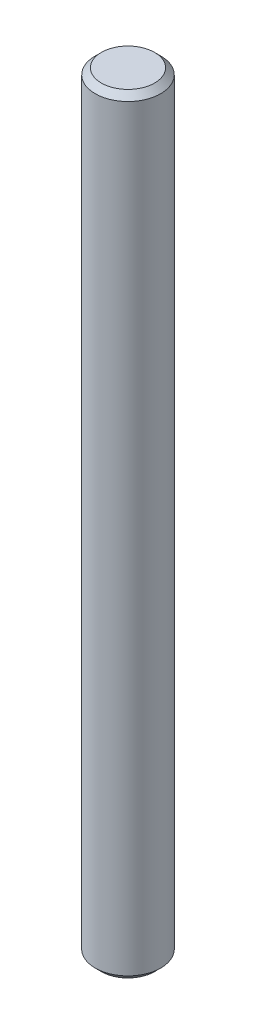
ISO-10303-21;
HEADER;
FILE_DESCRIPTION(('STEP AP214'),'2;1');
FILE_NAME('part.step','',(''),(''),'','','');
FILE_SCHEMA(('AUTOMOTIVE_DESIGN { 1 0 10303 214 1 1 1 1 }'));
ENDSEC;
DATA;
#1=APPLICATION_CONTEXT('core data for automotive mechanical design processes');
#2=APPLICATION_PROTOCOL_DEFINITION('international standard','automotive_design',2000,#1);
#3=PRODUCT_CONTEXT('',#1,'mechanical');
#4=PRODUCT('Part','Part','',(#3));
#5=PRODUCT_RELATED_PRODUCT_CATEGORY('part','',(#4));
#6=PRODUCT_DEFINITION_FORMATION('','',#4);
#7=PRODUCT_DEFINITION_CONTEXT('part definition',#1,'design');
#8=PRODUCT_DEFINITION('design','',#6,#7);
#9=PRODUCT_DEFINITION_SHAPE('','',#8);
#10=(LENGTH_UNIT() NAMED_UNIT(*) SI_UNIT(.MILLI.,.METRE.));
#11=(NAMED_UNIT(*) PLANE_ANGLE_UNIT() SI_UNIT($,.RADIAN.));
#12=(NAMED_UNIT(*) SI_UNIT($,.STERADIAN.) SOLID_ANGLE_UNIT());
#13=UNCERTAINTY_MEASURE_WITH_UNIT(LENGTH_MEASURE(1.E-05),#10,'distance_accuracy_value','');
#14=(GEOMETRIC_REPRESENTATION_CONTEXT(3) GLOBAL_UNCERTAINTY_ASSIGNED_CONTEXT((#13)) GLOBAL_UNIT_ASSIGNED_CONTEXT((#10,
#11,#12)) REPRESENTATION_CONTEXT('',''));
#15=CARTESIAN_POINT('',(0.,0.,0.));
#16=DIRECTION('',(0.,0.,1.));
#17=DIRECTION('',(1.,0.,0.));
#18=AXIS2_PLACEMENT_3D('',#15,#16,#17);
#19=CARTESIAN_POINT('',(0.,94.,0.));
#20=DIRECTION('',(0.,-1.,0.));
#21=DIRECTION('',(0.,0.,-1.));
#22=AXIS2_PLACEMENT_3D('',#19,#20,#21);
#23=CYLINDRICAL_SURFACE('',#22,4.);
#24=CARTESIAN_POINT('',(0.,93.25,0.));
#25=DIRECTION('',(0.,1.,0.));
#26=DIRECTION('',(0.,0.,1.));
#27=AXIS2_PLACEMENT_3D('',#24,#25,#26);
#28=CIRCLE('',#27,4.);
#29=CARTESIAN_POINT('',(0.,93.25,4.));
#30=VERTEX_POINT('',#29);
#31=EDGE_CURVE('E36',#30,#30,#28,.F.);
#32=ORIENTED_EDGE('',*,*,#31,.T.);
#33=EDGE_LOOP('',(#32));
#34=FACE_BOUND('',#33,.T.);
#35=CARTESIAN_POINT('',(0.,0.750000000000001,0.));
#36=DIRECTION('',(0.,1.,0.));
#37=DIRECTION('',(0.,0.,1.));
#38=AXIS2_PLACEMENT_3D('',#35,#36,#37);
#39=CIRCLE('',#38,4.);
#40=CARTESIAN_POINT('',(0.,0.750000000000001,4.));
#41=VERTEX_POINT('',#40);
#42=EDGE_CURVE('E40',#41,#41,#39,.T.);
#43=ORIENTED_EDGE('',*,*,#42,.T.);
#44=EDGE_LOOP('',(#43));
#45=FACE_BOUND('',#44,.T.);
#46=ADVANCED_FACE('F30',(#34,#45),#23,.T.);
#47=CARTESIAN_POINT('',(0.,94.,0.));
#48=DIRECTION('',(0.,1.,0.));
#49=DIRECTION('',(0.,0.,1.));
#50=AXIS2_PLACEMENT_3D('',#47,#48,#49);
#51=PLANE('',#50);
#52=CARTESIAN_POINT('',(0.,94.,0.));
#53=DIRECTION('',(0.,1.,0.));
#54=DIRECTION('',(0.,0.,1.));
#55=AXIS2_PLACEMENT_3D('',#52,#53,#54);
#56=CIRCLE('',#55,3.25000000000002);
#57=CARTESIAN_POINT('',(0.,94.,3.25000000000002));
#58=VERTEX_POINT('',#57);
#59=EDGE_CURVE('E44',#58,#58,#56,.T.);
#60=ORIENTED_EDGE('',*,*,#59,.T.);
#61=EDGE_LOOP('',(#60));
#62=FACE_BOUND('',#61,.T.);
#63=ADVANCED_FACE('F50',(#62),#51,.T.);
#64=CARTESIAN_POINT('',(0.,0.,0.));
#65=DIRECTION('',(0.,1.,0.));
#66=DIRECTION('',(0.,0.,1.));
#67=AXIS2_PLACEMENT_3D('',#64,#65,#66);
#68=PLANE('',#67);
#69=CARTESIAN_POINT('',(0.,0.,0.));
#70=DIRECTION('',(0.,1.,0.));
#71=DIRECTION('',(0.,0.,1.));
#72=AXIS2_PLACEMENT_3D('',#69,#70,#71);
#73=CIRCLE('',#72,3.25);
#74=CARTESIAN_POINT('',(0.,0.,3.25));
#75=VERTEX_POINT('',#74);
#76=EDGE_CURVE('E10',#75,#75,#73,.F.);
#77=ORIENTED_EDGE('',*,*,#76,.T.);
#78=EDGE_LOOP('',(#77));
#79=FACE_BOUND('',#78,.T.);
#80=ADVANCED_FACE('F55',(#79),#68,.F.);
#81=CARTESIAN_POINT('',(0.,94.,0.));
#82=DIRECTION('',(0.,-1.,0.));
#83=DIRECTION('',(0.,0.,-1.));
#84=AXIS2_PLACEMENT_3D('',#81,#82,#83);
#85=CONICAL_SURFACE('',#84,3.25000000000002,0.785398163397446);
#86=ORIENTED_EDGE('',*,*,#31,.F.);
#87=EDGE_LOOP('',(#86));
#88=FACE_BOUND('',#87,.T.);
#89=ORIENTED_EDGE('',*,*,#59,.F.);
#90=EDGE_LOOP('',(#89));
#91=FACE_BOUND('',#90,.T.);
#92=ADVANCED_FACE('F52',(#88,#91),#85,.T.);
#93=CARTESIAN_POINT('',(0.,0.750000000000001,0.));
#94=DIRECTION('',(0.,1.,0.));
#95=DIRECTION('',(0.,0.,1.));
#96=AXIS2_PLACEMENT_3D('',#93,#94,#95);
#97=CONICAL_SURFACE('',#96,4.,0.785398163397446);
#98=ORIENTED_EDGE('',*,*,#76,.F.);
#99=EDGE_LOOP('',(#98));
#100=FACE_BOUND('',#99,.T.);
#101=ORIENTED_EDGE('',*,*,#42,.F.);
#102=EDGE_LOOP('',(#101));
#103=FACE_BOUND('',#102,.T.);
#104=ADVANCED_FACE('F54',(#100,#103),#97,.T.);
#105=CLOSED_SHELL('',(#46,#63,#80,#92,#104));
#106=MANIFOLD_SOLID_BREP('B2',#105);
#107=ADVANCED_BREP_SHAPE_REPRESENTATION('',(#18,#106),#14);
#108=SHAPE_DEFINITION_REPRESENTATION(#9,#107);
ENDSEC;
END-ISO-10303-21;
